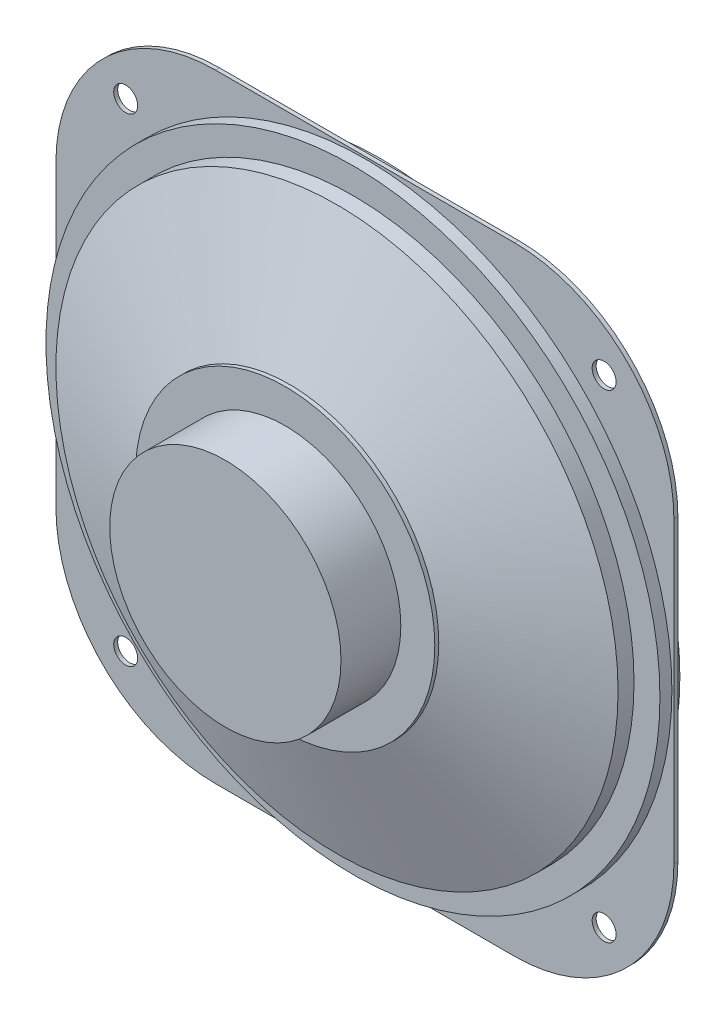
ISO-10303-21;
HEADER;
FILE_DESCRIPTION(('STEP AP214'),'2;1');
FILE_NAME('part.step','',(''),(''),'','','');
FILE_SCHEMA(('AUTOMOTIVE_DESIGN { 1 0 10303 214 1 1 1 1 }'));
ENDSEC;
DATA;
#1=APPLICATION_CONTEXT('core data for automotive mechanical design processes');
#2=APPLICATION_PROTOCOL_DEFINITION('international standard','automotive_design',2000,#1);
#3=PRODUCT_CONTEXT('',#1,'mechanical');
#4=PRODUCT('Part','Part','',(#3));
#5=PRODUCT_RELATED_PRODUCT_CATEGORY('part','',(#4));
#6=PRODUCT_DEFINITION_FORMATION('','',#4);
#7=PRODUCT_DEFINITION_CONTEXT('part definition',#1,'design');
#8=PRODUCT_DEFINITION('design','',#6,#7);
#9=PRODUCT_DEFINITION_SHAPE('','',#8);
#10=(LENGTH_UNIT() NAMED_UNIT(*) SI_UNIT(.MILLI.,.METRE.));
#11=(NAMED_UNIT(*) PLANE_ANGLE_UNIT() SI_UNIT($,.RADIAN.));
#12=(NAMED_UNIT(*) SI_UNIT($,.STERADIAN.) SOLID_ANGLE_UNIT());
#13=UNCERTAINTY_MEASURE_WITH_UNIT(LENGTH_MEASURE(1.E-05),#10,'distance_accuracy_value','');
#14=(GEOMETRIC_REPRESENTATION_CONTEXT(3) GLOBAL_UNCERTAINTY_ASSIGNED_CONTEXT((#13)) GLOBAL_UNIT_ASSIGNED_CONTEXT((#10,
#11,#12)) REPRESENTATION_CONTEXT('',''));
#15=CARTESIAN_POINT('',(0.,0.,0.));
#16=DIRECTION('',(0.,0.,1.));
#17=DIRECTION('',(1.,0.,0.));
#18=AXIS2_PLACEMENT_3D('',#15,#16,#17);
#19=CARTESIAN_POINT('',(0.,0.,18.));
#20=DIRECTION('',(0.,0.,-1.));
#21=DIRECTION('',(-1.,0.,0.));
#22=AXIS2_PLACEMENT_3D('',#19,#20,#21);
#23=CYLINDRICAL_SURFACE('',#22,14.5026515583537);
#24=CARTESIAN_POINT('',(0.,0.,18.));
#25=DIRECTION('',(0.,0.,1.));
#26=DIRECTION('',(1.,0.,0.));
#27=AXIS2_PLACEMENT_3D('',#24,#25,#26);
#28=CIRCLE('',#27,14.5026515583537);
#29=CARTESIAN_POINT('',(14.5026515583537,0.,18.));
#30=VERTEX_POINT('',#29);
#31=EDGE_CURVE('E11',#30,#30,#28,.T.);
#32=ORIENTED_EDGE('',*,*,#31,.F.);
#33=EDGE_LOOP('',(#32));
#34=FACE_BOUND('',#33,.T.);
#35=CARTESIAN_POINT('',(0.,0.,10.5));
#36=DIRECTION('',(0.,0.,1.));
#37=DIRECTION('',(1.,0.,0.));
#38=AXIS2_PLACEMENT_3D('',#35,#36,#37);
#39=CIRCLE('',#38,14.5026515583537);
#40=CARTESIAN_POINT('',(14.5026515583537,0.,10.5));
#41=VERTEX_POINT('',#40);
#42=EDGE_CURVE('E63',#41,#41,#39,.T.);
#43=ORIENTED_EDGE('',*,*,#42,.T.);
#44=EDGE_LOOP('',(#43));
#45=FACE_BOUND('',#44,.T.);
#46=ADVANCED_FACE('F60',(#34,#45),#23,.T.);
#47=CARTESIAN_POINT('',(0.,0.,18.));
#48=DIRECTION('',(0.,0.,1.));
#49=DIRECTION('',(1.,0.,0.));
#50=AXIS2_PLACEMENT_3D('',#47,#48,#49);
#51=PLANE('',#50);
#52=ORIENTED_EDGE('',*,*,#31,.T.);
#53=EDGE_LOOP('',(#52));
#54=FACE_BOUND('',#53,.T.);
#55=ADVANCED_FACE('F75',(#54),#51,.T.);
#56=CARTESIAN_POINT('',(0.,0.,10.5));
#57=DIRECTION('',(0.,0.,1.));
#58=DIRECTION('',(1.,0.,0.));
#59=AXIS2_PLACEMENT_3D('',#56,#57,#58);
#60=PLANE('',#59);
#61=ORIENTED_EDGE('',*,*,#42,.F.);
#62=EDGE_LOOP('',(#61));
#63=FACE_BOUND('',#62,.T.);
#64=ADVANCED_FACE('F73',(#63),#60,.F.);
#65=CLOSED_SHELL('',(#46,#55,#64));
#66=MANIFOLD_SOLID_BREP('B2',#65);
#67=CARTESIAN_POINT('',(0.,0.,2.));
#68=DIRECTION('',(0.,0.,1.));
#69=DIRECTION('',(1.,0.,0.));
#70=AXIS2_PLACEMENT_3D('',#67,#68,#69);
#71=PLANE('',#70);
#72=CARTESIAN_POINT('',(0.,0.,2.));
#73=DIRECTION('',(0.,0.,1.));
#74=DIRECTION('',(1.,0.,0.));
#75=AXIS2_PLACEMENT_3D('',#72,#73,#74);
#76=CIRCLE('',#75,34.4848645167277);
#77=CARTESIAN_POINT('',(-34.4848645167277,0.,2.));
#78=VERTEX_POINT('',#77);
#79=EDGE_CURVE('E136',#78,#78,#76,.T.);
#80=ORIENTED_EDGE('',*,*,#79,.T.);
#81=EDGE_LOOP('',(#80));
#82=FACE_BOUND('',#81,.T.);
#83=CARTESIAN_POINT('',(0.,0.,2.));
#84=DIRECTION('',(0.,0.,1.));
#85=DIRECTION('',(1.,0.,0.));
#86=AXIS2_PLACEMENT_3D('',#83,#84,#85);
#87=CIRCLE('',#86,35.25);
#88=CARTESIAN_POINT('',(35.25,0.,2.));
#89=VERTEX_POINT('',#88);
#90=EDGE_CURVE('E152',#89,#89,#87,.T.);
#91=ORIENTED_EDGE('',*,*,#90,.F.);
#92=EDGE_LOOP('',(#91));
#93=FACE_BOUND('',#92,.T.);
#94=ADVANCED_FACE('F127',(#82,#93),#71,.F.);
#95=CARTESIAN_POINT('',(0.,0.,10.));
#96=DIRECTION('',(0.,0.,-1.));
#97=DIRECTION('',(-1.,0.,0.));
#98=AXIS2_PLACEMENT_3D('',#95,#96,#97);
#99=CYLINDRICAL_SURFACE('',#98,35.25);
#100=CARTESIAN_POINT('',(0.,0.,3.99999999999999));
#101=DIRECTION('',(0.,0.,1.));
#102=DIRECTION('',(1.,0.,0.));
#103=AXIS2_PLACEMENT_3D('',#100,#101,#102);
#104=CIRCLE('',#103,35.25);
#105=CARTESIAN_POINT('',(35.25,0.,3.99999999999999));
#106=VERTEX_POINT('',#105);
#107=EDGE_CURVE('E141',#106,#106,#104,.F.);
#108=ORIENTED_EDGE('',*,*,#107,.T.);
#109=EDGE_LOOP('',(#108));
#110=FACE_BOUND('',#109,.T.);
#111=ORIENTED_EDGE('',*,*,#90,.T.);
#112=EDGE_LOOP('',(#111));
#113=FACE_BOUND('',#112,.T.);
#114=ADVANCED_FACE('F193',(#110,#113),#99,.T.);
#115=CARTESIAN_POINT('',(0.,0.,10.));
#116=DIRECTION('',(0.,0.,-1.));
#117=DIRECTION('',(-1.,0.,0.));
#118=AXIS2_PLACEMENT_3D('',#115,#116,#117);
#119=CYLINDRICAL_SURFACE('',#118,18.);
#120=CARTESIAN_POINT('',(0.,0.,8.00000000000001));
#121=DIRECTION('',(0.,0.,1.));
#122=DIRECTION('',(1.,0.,0.));
#123=AXIS2_PLACEMENT_3D('',#120,#121,#122);
#124=CIRCLE('',#123,18.);
#125=CARTESIAN_POINT('',(-18.,0.,8.00000000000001));
#126=VERTEX_POINT('',#125);
#127=EDGE_CURVE('E59',#126,#126,#124,.F.);
#128=ORIENTED_EDGE('',*,*,#127,.T.);
#129=EDGE_LOOP('',(#128));
#130=FACE_BOUND('',#129,.T.);
#131=CARTESIAN_POINT('',(0.,0.,10.));
#132=DIRECTION('',(0.,0.,1.));
#133=DIRECTION('',(1.,0.,0.));
#134=AXIS2_PLACEMENT_3D('',#131,#132,#133);
#135=CIRCLE('',#134,18.);
#136=CARTESIAN_POINT('',(18.,0.,10.));
#137=VERTEX_POINT('',#136);
#138=EDGE_CURVE('E156',#137,#137,#135,.T.);
#139=ORIENTED_EDGE('',*,*,#138,.T.);
#140=EDGE_LOOP('',(#139));
#141=FACE_BOUND('',#140,.T.);
#142=ADVANCED_FACE('F200',(#130,#141),#119,.F.);
#143=CARTESIAN_POINT('',(0.,0.,10.));
#144=DIRECTION('',(0.,0.,-1.));
#145=DIRECTION('',(-1.,0.,0.));
#146=AXIS2_PLACEMENT_3D('',#143,#144,#145);
#147=CONICAL_SURFACE('',#146,18.7651354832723,1.22173047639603);
#148=ORIENTED_EDGE('',*,*,#107,.F.);
#149=EDGE_LOOP('',(#148));
#150=FACE_BOUND('',#149,.T.);
#151=CARTESIAN_POINT('',(0.,0.,10.));
#152=DIRECTION('',(0.,0.,1.));
#153=DIRECTION('',(1.,0.,0.));
#154=AXIS2_PLACEMENT_3D('',#151,#152,#153);
#155=CIRCLE('',#154,18.7651354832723);
#156=CARTESIAN_POINT('',(18.7651354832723,0.,10.));
#157=VERTEX_POINT('',#156);
#158=EDGE_CURVE('E146',#157,#157,#155,.T.);
#159=ORIENTED_EDGE('',*,*,#158,.F.);
#160=EDGE_LOOP('',(#159));
#161=FACE_BOUND('',#160,.T.);
#162=ADVANCED_FACE('F188',(#150,#161),#147,.T.);
#163=CARTESIAN_POINT('',(0.,0.,10.));
#164=DIRECTION('',(0.,0.,1.));
#165=DIRECTION('',(1.,0.,0.));
#166=AXIS2_PLACEMENT_3D('',#163,#164,#165);
#167=PLANE('',#166);
#168=CARTESIAN_POINT('',(0.,0.,10.));
#169=DIRECTION('',(0.,0.,1.));
#170=DIRECTION('',(1.,0.,0.));
#171=AXIS2_PLACEMENT_3D('',#168,#169,#170);
#172=CIRCLE('',#171,14.5026515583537);
#173=CARTESIAN_POINT('',(14.5026515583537,0.,10.));
#174=VERTEX_POINT('',#173);
#175=EDGE_CURVE('E165',#174,#174,#172,.T.);
#176=ORIENTED_EDGE('',*,*,#175,.T.);
#177=EDGE_LOOP('',(#176));
#178=FACE_BOUND('',#177,.T.);
#179=ORIENTED_EDGE('',*,*,#138,.F.);
#180=EDGE_LOOP('',(#179));
#181=FACE_BOUND('',#180,.T.);
#182=ADVANCED_FACE('F179',(#178,#181),#167,.F.);
#183=CARTESIAN_POINT('',(0.,0.,10.5));
#184=DIRECTION('',(0.,0.,1.));
#185=DIRECTION('',(1.,0.,0.));
#186=AXIS2_PLACEMENT_3D('',#183,#184,#185);
#187=PLANE('',#186);
#188=CARTESIAN_POINT('',(0.,0.,10.5));
#189=DIRECTION('',(0.,0.,1.));
#190=DIRECTION('',(1.,0.,0.));
#191=AXIS2_PLACEMENT_3D('',#188,#189,#190);
#192=CIRCLE('',#191,18.7651354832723);
#193=CARTESIAN_POINT('',(18.7651354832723,0.,10.5));
#194=VERTEX_POINT('',#193);
#195=EDGE_CURVE('E160',#194,#194,#192,.T.);
#196=ORIENTED_EDGE('',*,*,#195,.T.);
#197=EDGE_LOOP('',(#196));
#198=FACE_BOUND('',#197,.T.);
#199=CARTESIAN_POINT('',(0.,0.,10.5));
#200=DIRECTION('',(0.,0.,1.));
#201=DIRECTION('',(1.,0.,0.));
#202=AXIS2_PLACEMENT_3D('',#199,#200,#201);
#203=CIRCLE('',#202,14.5026515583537);
#204=CARTESIAN_POINT('',(14.5026515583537,0.,10.5));
#205=VERTEX_POINT('',#204);
#206=EDGE_CURVE('E164',#205,#205,#203,.T.);
#207=ORIENTED_EDGE('',*,*,#206,.F.);
#208=EDGE_LOOP('',(#207));
#209=FACE_BOUND('',#208,.T.);
#210=ADVANCED_FACE('F176',(#198,#209),#187,.T.);
#211=CARTESIAN_POINT('',(0.,0.,10.5));
#212=DIRECTION('',(0.,0.,-1.));
#213=DIRECTION('',(-1.,0.,0.));
#214=AXIS2_PLACEMENT_3D('',#211,#212,#213);
#215=CYLINDRICAL_SURFACE('',#214,18.7651354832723);
#216=ORIENTED_EDGE('',*,*,#195,.F.);
#217=EDGE_LOOP('',(#216));
#218=FACE_BOUND('',#217,.T.);
#219=ORIENTED_EDGE('',*,*,#158,.T.);
#220=EDGE_LOOP('',(#219));
#221=FACE_BOUND('',#220,.T.);
#222=ADVANCED_FACE('F178',(#218,#221),#215,.T.);
#223=CARTESIAN_POINT('',(0.,0.,10.5));
#224=DIRECTION('',(0.,0.,-1.));
#225=DIRECTION('',(-1.,0.,0.));
#226=AXIS2_PLACEMENT_3D('',#223,#224,#225);
#227=CYLINDRICAL_SURFACE('',#226,14.5026515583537);
#228=ORIENTED_EDGE('',*,*,#206,.T.);
#229=EDGE_LOOP('',(#228));
#230=FACE_BOUND('',#229,.T.);
#231=ORIENTED_EDGE('',*,*,#175,.F.);
#232=EDGE_LOOP('',(#231));
#233=FACE_BOUND('',#232,.T.);
#234=ADVANCED_FACE('F173',(#230,#233),#227,.F.);
#235=CARTESIAN_POINT('',(0.,0.,2.));
#236=DIRECTION('',(0.,0.,-1.));
#237=DIRECTION('',(-1.,0.,0.));
#238=AXIS2_PLACEMENT_3D('',#235,#236,#237);
#239=CONICAL_SURFACE('',#238,34.4848645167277,1.22173047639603);
#240=CARTESIAN_POINT('',(-18.,0.,8.00000000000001));
#241=CARTESIAN_POINT('',(-18.1717173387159,0.,7.93750000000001));
#242=CARTESIAN_POINT('',(-18.3434346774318,0.,7.87500000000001));
#243=CARTESIAN_POINT('',(-18.6868693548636,0.,7.75000000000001));
#244=CARTESIAN_POINT('',(-18.8585866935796,0.,7.68750000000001));
#245=CARTESIAN_POINT('',(-19.2020213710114,0.,7.56250000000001));
#246=CARTESIAN_POINT('',(-19.3737387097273,0.,7.50000000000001));
#247=CARTESIAN_POINT('',(-19.7171733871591,0.,7.37500000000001));
#248=CARTESIAN_POINT('',(-19.888890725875,0.,7.31250000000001));
#249=CARTESIAN_POINT('',(-20.2323254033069,0.,7.18750000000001));
#250=CARTESIAN_POINT('',(-20.4040427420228,0.,7.12500000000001));
#251=CARTESIAN_POINT('',(-20.7474774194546,0.,7.00000000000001));
#252=CARTESIAN_POINT('',(-20.9191947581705,0.,6.93750000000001));
#253=CARTESIAN_POINT('',(-21.2626294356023,0.,6.81250000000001));
#254=CARTESIAN_POINT('',(-21.4343467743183,0.,6.75000000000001));
#255=CARTESIAN_POINT('',(-21.7777814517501,0.,6.62500000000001));
#256=CARTESIAN_POINT('',(-21.949498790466,0.,6.56250000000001));
#257=CARTESIAN_POINT('',(-22.2929334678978,0.,6.4375));
#258=CARTESIAN_POINT('',(-22.4646508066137,0.,6.375));
#259=CARTESIAN_POINT('',(-22.8080854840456,0.,6.25));
#260=CARTESIAN_POINT('',(-22.9798028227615,0.,6.1875));
#261=CARTESIAN_POINT('',(-23.3232375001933,0.,6.0625));
#262=CARTESIAN_POINT('',(-23.4949548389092,0.,6.));
#263=CARTESIAN_POINT('',(-23.8383895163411,0.,5.875));
#264=CARTESIAN_POINT('',(-24.010106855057,0.,5.8125));
#265=CARTESIAN_POINT('',(-24.3535415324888,0.,5.6875));
#266=CARTESIAN_POINT('',(-24.5252588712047,0.,5.625));
#267=CARTESIAN_POINT('',(-24.8686935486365,0.,5.5));
#268=CARTESIAN_POINT('',(-25.0404108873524,0.,5.4375));
#269=CARTESIAN_POINT('',(-25.3838455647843,0.,5.3125));
#270=CARTESIAN_POINT('',(-25.5555629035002,0.,5.25));
#271=CARTESIAN_POINT('',(-25.898997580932,0.,5.125));
#272=CARTESIAN_POINT('',(-26.0707149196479,0.,5.0625));
#273=CARTESIAN_POINT('',(-26.4141495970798,0.,4.9375));
#274=CARTESIAN_POINT('',(-26.5858669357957,0.,4.875));
#275=CARTESIAN_POINT('',(-26.9293016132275,0.,4.75));
#276=CARTESIAN_POINT('',(-27.1010189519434,0.,4.6875));
#277=CARTESIAN_POINT('',(-27.4444536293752,0.,4.5625));
#278=CARTESIAN_POINT('',(-27.6161709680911,0.,4.5));
#279=CARTESIAN_POINT('',(-27.959605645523,0.,4.375));
#280=CARTESIAN_POINT('',(-28.1313229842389,0.,4.3125));
#281=CARTESIAN_POINT('',(-28.4747576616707,0.,4.1875));
#282=CARTESIAN_POINT('',(-28.6464750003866,0.,4.125));
#283=CARTESIAN_POINT('',(-28.9899096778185,0.,4.));
#284=CARTESIAN_POINT('',(-29.1616270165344,0.,3.9375));
#285=CARTESIAN_POINT('',(-29.5050616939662,0.,3.8125));
#286=CARTESIAN_POINT('',(-29.6767790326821,0.,3.75));
#287=CARTESIAN_POINT('',(-30.0202137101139,0.,3.625));
#288=CARTESIAN_POINT('',(-30.1919310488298,0.,3.5625));
#289=CARTESIAN_POINT('',(-30.5353657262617,0.,3.4375));
#290=CARTESIAN_POINT('',(-30.7070830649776,0.,3.375));
#291=CARTESIAN_POINT('',(-31.0505177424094,0.,3.25));
#292=CARTESIAN_POINT('',(-31.2222350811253,0.,3.1875));
#293=CARTESIAN_POINT('',(-31.5656697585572,0.,3.0625));
#294=CARTESIAN_POINT('',(-31.7373870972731,0.,3.));
#295=CARTESIAN_POINT('',(-32.0808217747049,0.,2.875));
#296=CARTESIAN_POINT('',(-32.2525391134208,0.,2.8125));
#297=CARTESIAN_POINT('',(-32.5959737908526,0.,2.6875));
#298=CARTESIAN_POINT('',(-32.7676911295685,0.,2.625));
#299=CARTESIAN_POINT('',(-33.1111258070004,0.,2.5));
#300=CARTESIAN_POINT('',(-33.2828431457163,0.,2.4375));
#301=CARTESIAN_POINT('',(-33.6262778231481,0.,2.3125));
#302=CARTESIAN_POINT('',(-33.797995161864,0.,2.25));
#303=CARTESIAN_POINT('',(-34.1414298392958,0.,2.125));
#304=CARTESIAN_POINT('',(-34.3131471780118,0.,2.0625));
#305=CARTESIAN_POINT('',(-34.4848645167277,0.,2.));
#306=B_SPLINE_CURVE_WITH_KNOTS('',3,(#240,#241,#242,#243,#244,#245,#246,#247,#248,#249,#250,
#251,#252,#253,#254,#255,#256,#257,#258,#259,#260,#261,#262,#263,#264,#265,#266,#267,#268,#269,
#270,#271,#272,#273,#274,#275,#276,#277,#278,#279,#280,#281,#282,#283,#284,#285,#286,#287,#288,
#289,#290,#291,#292,#293,#294,#295,#296,#297,#298,#299,#300,#301,#302,#303,#304,#305),
.UNSPECIFIED.,.F.,.F.,(4,2,2,2,2,2,2,2,2,2,2,2,2,2,2,2,2,2,2,2,2,2,2,2,2,2,2,2,2,2,2,2,4),(0.,
0.548213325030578,1.09642665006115,1.64463997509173,2.19285330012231,2.74106662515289,
3.28927995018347,3.83749327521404,4.38570660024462,4.93391992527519,5.48213325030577,
6.03034657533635,6.57855990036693,7.12677322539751,7.67498655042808,8.22319987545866,
8.77141320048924,9.31962652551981,9.86783985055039,10.416053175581,10.9642665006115,
11.5124798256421,12.0606931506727,12.6089064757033,13.1571198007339,13.7053331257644,
14.253546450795,14.8017597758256,15.3499731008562,15.8981864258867,16.4463997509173,
16.9946130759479,17.5428264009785),.UNSPECIFIED.);
#307=EDGE_CURVE('BSEAM130',#126,#78,#306,.T.);
#308=ORIENTED_EDGE('',*,*,#127,.F.);
#309=ORIENTED_EDGE('',*,*,#79,.F.);
#310=ORIENTED_EDGE('',*,*,#307,.T.);
#311=ORIENTED_EDGE('',*,*,#307,.F.);
#312=EDGE_LOOP('',(#308,#310,#309,#311));
#313=FACE_BOUND('',#312,.T.);
#314=ADVANCED_FACE('F130',(#313),#239,.F.);
#315=CLOSED_SHELL('',(#94,#114,#142,#162,#182,#210,#222,#234,#314));
#316=MANIFOLD_SOLID_BREP('B6',#315);
#317=CARTESIAN_POINT('',(0.,0.,0.5));
#318=DIRECTION('',(0.,0.,1.));
#319=DIRECTION('',(1.,0.,0.));
#320=AXIS2_PLACEMENT_3D('',#317,#318,#319);
#321=PLANE('',#320);
#322=CARTESIAN_POINT('',(0.,0.,0.5));
#323=DIRECTION('',(0.,0.,1.));
#324=DIRECTION('',(1.,0.,0.));
#325=AXIS2_PLACEMENT_3D('',#322,#323,#324);
#326=CIRCLE('',#325,35.25);
#327=CARTESIAN_POINT('',(35.25,0.,0.5));
#328=VERTEX_POINT('',#327);
#329=EDGE_CURVE('E304',#328,#328,#326,.T.);
#330=ORIENTED_EDGE('',*,*,#329,.T.);
#331=EDGE_LOOP('',(#330));
#332=FACE_BOUND('',#331,.T.);
#333=CARTESIAN_POINT('',(0.,0.,0.5));
#334=DIRECTION('',(0.,0.,1.));
#335=DIRECTION('',(1.,0.,0.));
#336=AXIS2_PLACEMENT_3D('',#333,#334,#335);
#337=CIRCLE('',#336,35.5);
#338=CARTESIAN_POINT('',(-35.5,0.,0.5));
#339=VERTEX_POINT('',#338);
#340=EDGE_CURVE('E126',#339,#339,#337,.T.);
#341=ORIENTED_EDGE('',*,*,#340,.F.);
#342=EDGE_LOOP('',(#341));
#343=FACE_BOUND('',#342,.T.);
#344=ADVANCED_FACE('F286',(#332,#343),#321,.F.);
#345=CARTESIAN_POINT('',(0.,0.,2.));
#346=DIRECTION('',(0.,0.,1.));
#347=DIRECTION('',(1.,0.,0.));
#348=AXIS2_PLACEMENT_3D('',#345,#346,#347);
#349=PLANE('',#348);
#350=CARTESIAN_POINT('',(0.,0.,2.));
#351=DIRECTION('',(0.,0.,1.));
#352=DIRECTION('',(1.,0.,0.));
#353=AXIS2_PLACEMENT_3D('',#350,#351,#352);
#354=CIRCLE('',#353,38.5);
#355=CARTESIAN_POINT('',(38.5,0.,2.));
#356=VERTEX_POINT('',#355);
#357=EDGE_CURVE('E294',#356,#356,#354,.T.);
#358=ORIENTED_EDGE('',*,*,#357,.T.);
#359=EDGE_LOOP('',(#358));
#360=FACE_BOUND('',#359,.T.);
#361=CARTESIAN_POINT('',(0.,0.,2.));
#362=DIRECTION('',(0.,0.,1.));
#363=DIRECTION('',(1.,0.,0.));
#364=AXIS2_PLACEMENT_3D('',#361,#362,#363);
#365=CIRCLE('',#364,35.25);
#366=CARTESIAN_POINT('',(35.25,0.,2.));
#367=VERTEX_POINT('',#366);
#368=EDGE_CURVE('E302',#367,#367,#365,.T.);
#369=ORIENTED_EDGE('',*,*,#368,.F.);
#370=EDGE_LOOP('',(#369));
#371=FACE_BOUND('',#370,.T.);
#372=ADVANCED_FACE('F328',(#360,#371),#349,.T.);
#373=CARTESIAN_POINT('',(0.,0.,0.5));
#374=DIRECTION('',(0.,0.,1.));
#375=DIRECTION('',(1.,0.,0.));
#376=AXIS2_PLACEMENT_3D('',#373,#374,#375);
#377=CIRCLE('',#376,37.5);
#378=CARTESIAN_POINT('',(-37.5,0.,0.5));
#379=VERTEX_POINT('',#378);
#380=EDGE_CURVE('E290',#379,#379,#377,.T.);
#381=ORIENTED_EDGE('',*,*,#380,.T.);
#382=EDGE_LOOP('',(#381));
#383=FACE_BOUND('',#382,.T.);
#384=CARTESIAN_POINT('',(0.,0.,0.5));
#385=DIRECTION('',(0.,0.,1.));
#386=DIRECTION('',(1.,0.,0.));
#387=AXIS2_PLACEMENT_3D('',#384,#385,#386);
#388=CIRCLE('',#387,38.5);
#389=CARTESIAN_POINT('',(38.5,0.,0.5));
#390=VERTEX_POINT('',#389);
#391=EDGE_CURVE('E298',#390,#390,#388,.T.);
#392=ORIENTED_EDGE('',*,*,#391,.F.);
#393=EDGE_LOOP('',(#392));
#394=FACE_BOUND('',#393,.T.);
#395=ADVANCED_FACE('F330',(#383,#394),#321,.F.);
#396=CARTESIAN_POINT('',(0.,0.,2.));
#397=DIRECTION('',(0.,0.,-1.));
#398=DIRECTION('',(-1.,0.,0.));
#399=AXIS2_PLACEMENT_3D('',#396,#397,#398);
#400=CYLINDRICAL_SURFACE('',#399,38.5);
#401=ORIENTED_EDGE('',*,*,#357,.F.);
#402=EDGE_LOOP('',(#401));
#403=FACE_BOUND('',#402,.T.);
#404=ORIENTED_EDGE('',*,*,#391,.T.);
#405=EDGE_LOOP('',(#404));
#406=FACE_BOUND('',#405,.T.);
#407=ADVANCED_FACE('F288',(#403,#406),#400,.T.);
#408=CARTESIAN_POINT('',(0.,0.,2.));
#409=DIRECTION('',(0.,0.,-1.));
#410=DIRECTION('',(-1.,0.,0.));
#411=AXIS2_PLACEMENT_3D('',#408,#409,#410);
#412=CYLINDRICAL_SURFACE('',#411,35.25);
#413=ORIENTED_EDGE('',*,*,#368,.T.);
#414=EDGE_LOOP('',(#413));
#415=FACE_BOUND('',#414,.T.);
#416=ORIENTED_EDGE('',*,*,#329,.F.);
#417=EDGE_LOOP('',(#416));
#418=FACE_BOUND('',#417,.T.);
#419=ADVANCED_FACE('F344',(#415,#418),#412,.F.);
#420=CARTESIAN_POINT('',(0.,0.,1.9));
#421=DIRECTION('',(0.,0.,-1.));
#422=DIRECTION('',(-1.,0.,0.));
#423=AXIS2_PLACEMENT_3D('',#420,#421,#422);
#424=CYLINDRICAL_SURFACE('',#423,37.5);
#425=CARTESIAN_POINT('',(0.,0.,-1.5));
#426=DIRECTION('',(0.,0.,-1.));
#427=DIRECTION('',(-1.,0.,0.));
#428=AXIS2_PLACEMENT_3D('',#425,#426,#427);
#429=CIRCLE('',#428,37.5);
#430=CARTESIAN_POINT('',(-37.5,0.,-1.5));
#431=VERTEX_POINT('',#430);
#432=EDGE_CURVE('E309',#431,#431,#429,.T.);
#433=CARTESIAN_POINT('',(-37.5,0.,-1.5));
#434=CARTESIAN_POINT('',(-37.5,0.,-1.47916666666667));
#435=CARTESIAN_POINT('',(-37.5,0.,-1.45833333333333));
#436=CARTESIAN_POINT('',(-37.5,0.,-1.41666666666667));
#437=CARTESIAN_POINT('',(-37.5,0.,-1.39583333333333));
#438=CARTESIAN_POINT('',(-37.5,0.,-1.35416666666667));
#439=CARTESIAN_POINT('',(-37.5,0.,-1.33333333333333));
#440=CARTESIAN_POINT('',(-37.5,0.,-1.29166666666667));
#441=CARTESIAN_POINT('',(-37.5,0.,-1.27083333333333));
#442=CARTESIAN_POINT('',(-37.5,0.,-1.22916666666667));
#443=CARTESIAN_POINT('',(-37.5,0.,-1.20833333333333));
#444=CARTESIAN_POINT('',(-37.5,0.,-1.16666666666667));
#445=CARTESIAN_POINT('',(-37.5,0.,-1.14583333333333));
#446=CARTESIAN_POINT('',(-37.5,0.,-1.10416666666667));
#447=CARTESIAN_POINT('',(-37.5,0.,-1.08333333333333));
#448=CARTESIAN_POINT('',(-37.5,0.,-1.04166666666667));
#449=CARTESIAN_POINT('',(-37.5,0.,-1.02083333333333));
#450=CARTESIAN_POINT('',(-37.5,0.,-0.979166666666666));
#451=CARTESIAN_POINT('',(-37.5,0.,-0.958333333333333));
#452=CARTESIAN_POINT('',(-37.5,0.,-0.916666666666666));
#453=CARTESIAN_POINT('',(-37.5,0.,-0.895833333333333));
#454=CARTESIAN_POINT('',(-37.5,0.,-0.854166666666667));
#455=CARTESIAN_POINT('',(-37.5,0.,-0.833333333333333));
#456=CARTESIAN_POINT('',(-37.5,0.,-0.791666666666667));
#457=CARTESIAN_POINT('',(-37.5,0.,-0.770833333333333));
#458=CARTESIAN_POINT('',(-37.5,0.,-0.729166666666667));
#459=CARTESIAN_POINT('',(-37.5,0.,-0.708333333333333));
#460=CARTESIAN_POINT('',(-37.5,0.,-0.666666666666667));
#461=CARTESIAN_POINT('',(-37.5,0.,-0.645833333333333));
#462=CARTESIAN_POINT('',(-37.5,0.,-0.604166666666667));
#463=CARTESIAN_POINT('',(-37.5,0.,-0.583333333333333));
#464=CARTESIAN_POINT('',(-37.5,0.,-0.541666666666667));
#465=CARTESIAN_POINT('',(-37.5,0.,-0.520833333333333));
#466=CARTESIAN_POINT('',(-37.5,0.,-0.479166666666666));
#467=CARTESIAN_POINT('',(-37.5,0.,-0.458333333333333));
#468=CARTESIAN_POINT('',(-37.5,0.,-0.416666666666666));
#469=CARTESIAN_POINT('',(-37.5,0.,-0.395833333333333));
#470=CARTESIAN_POINT('',(-37.5,0.,-0.354166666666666));
#471=CARTESIAN_POINT('',(-37.5,0.,-0.333333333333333));
#472=CARTESIAN_POINT('',(-37.5,0.,-0.291666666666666));
#473=CARTESIAN_POINT('',(-37.5,0.,-0.270833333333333));
#474=CARTESIAN_POINT('',(-37.5,0.,-0.229166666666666));
#475=CARTESIAN_POINT('',(-37.5,0.,-0.208333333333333));
#476=CARTESIAN_POINT('',(-37.5,0.,-0.166666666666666));
#477=CARTESIAN_POINT('',(-37.5,0.,-0.145833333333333));
#478=CARTESIAN_POINT('',(-37.5,0.,-0.104166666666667));
#479=CARTESIAN_POINT('',(-37.5,0.,-0.0833333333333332));
#480=CARTESIAN_POINT('',(-37.5,0.,-0.0416666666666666));
#481=CARTESIAN_POINT('',(-37.5,0.,-0.0208333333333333));
#482=CARTESIAN_POINT('',(-37.5,0.,0.0208333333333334));
#483=CARTESIAN_POINT('',(-37.5,0.,0.0416666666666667));
#484=CARTESIAN_POINT('',(-37.5,0.,0.0833333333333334));
#485=CARTESIAN_POINT('',(-37.5,0.,0.104166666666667));
#486=CARTESIAN_POINT('',(-37.5,0.,0.145833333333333));
#487=CARTESIAN_POINT('',(-37.5,0.,0.166666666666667));
#488=CARTESIAN_POINT('',(-37.5,0.,0.208333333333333));
#489=CARTESIAN_POINT('',(-37.5,0.,0.229166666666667));
#490=CARTESIAN_POINT('',(-37.5,0.,0.270833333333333));
#491=CARTESIAN_POINT('',(-37.5,0.,0.291666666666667));
#492=CARTESIAN_POINT('',(-37.5,0.,0.333333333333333));
#493=CARTESIAN_POINT('',(-37.5,0.,0.354166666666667));
#494=CARTESIAN_POINT('',(-37.5,0.,0.395833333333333));
#495=CARTESIAN_POINT('',(-37.5,0.,0.416666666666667));
#496=CARTESIAN_POINT('',(-37.5,0.,0.458333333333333));
#497=CARTESIAN_POINT('',(-37.5,0.,0.479166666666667));
#498=CARTESIAN_POINT('',(-37.5,0.,0.5));
#499=B_SPLINE_CURVE_WITH_KNOTS('',3,(#433,#434,#435,#436,#437,#438,#439,#440,#441,#442,#443,
#444,#445,#446,#447,#448,#449,#450,#451,#452,#453,#454,#455,#456,#457,#458,#459,#460,#461,#462,
#463,#464,#465,#466,#467,#468,#469,#470,#471,#472,#473,#474,#475,#476,#477,#478,#479,#480,#481,
#482,#483,#484,#485,#486,#487,#488,#489,#490,#491,#492,#493,#494,#495,#496,#497,#498),
.UNSPECIFIED.,.F.,.F.,(4,2,2,2,2,2,2,2,2,2,2,2,2,2,2,2,2,2,2,2,2,2,2,2,2,2,2,2,2,2,2,2,4),(0.,
0.0625000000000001,0.125,0.1875,0.25,0.3125,0.375,0.4375,0.5,0.5625,0.625,0.6875,0.75,0.8125,
0.875,0.9375,1.,1.0625,1.125,1.1875,1.25,1.3125,1.375,1.4375,1.5,1.5625,1.625,1.6875,1.75,
1.8125,1.875,1.9375,2.),.UNSPECIFIED.);
#500=EDGE_CURVE('BSEAM325',#431,#379,#499,.T.);
#501=ORIENTED_EDGE('',*,*,#432,.F.);
#502=ORIENTED_EDGE('',*,*,#380,.F.);
#503=ORIENTED_EDGE('',*,*,#500,.T.);
#504=ORIENTED_EDGE('',*,*,#500,.F.);
#505=EDGE_LOOP('',(#501,#503,#502,#504));
#506=FACE_BOUND('',#505,.T.);
#507=ADVANCED_FACE('F325',(#506),#424,.T.);
#508=CARTESIAN_POINT('',(0.,0.,1.9));
#509=DIRECTION('',(0.,0.,-1.));
#510=DIRECTION('',(-1.,0.,0.));
#511=AXIS2_PLACEMENT_3D('',#508,#509,#510);
#512=CYLINDRICAL_SURFACE('',#511,35.5);
#513=CARTESIAN_POINT('',(0.,0.,-1.5));
#514=DIRECTION('',(0.,0.,-1.));
#515=DIRECTION('',(-1.,0.,0.));
#516=AXIS2_PLACEMENT_3D('',#513,#514,#515);
#517=CIRCLE('',#516,35.5);
#518=CARTESIAN_POINT('',(-35.5,0.,-1.5));
#519=VERTEX_POINT('',#518);
#520=EDGE_CURVE('E312',#519,#519,#517,.T.);
#521=CARTESIAN_POINT('',(-35.5,0.,-1.5));
#522=CARTESIAN_POINT('',(-35.5,0.,-1.47916666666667));
#523=CARTESIAN_POINT('',(-35.5,0.,-1.45833333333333));
#524=CARTESIAN_POINT('',(-35.5,0.,-1.41666666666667));
#525=CARTESIAN_POINT('',(-35.5,0.,-1.39583333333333));
#526=CARTESIAN_POINT('',(-35.5,0.,-1.35416666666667));
#527=CARTESIAN_POINT('',(-35.5,0.,-1.33333333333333));
#528=CARTESIAN_POINT('',(-35.5,0.,-1.29166666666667));
#529=CARTESIAN_POINT('',(-35.5,0.,-1.27083333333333));
#530=CARTESIAN_POINT('',(-35.5,0.,-1.22916666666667));
#531=CARTESIAN_POINT('',(-35.5,0.,-1.20833333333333));
#532=CARTESIAN_POINT('',(-35.5,0.,-1.16666666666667));
#533=CARTESIAN_POINT('',(-35.5,0.,-1.14583333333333));
#534=CARTESIAN_POINT('',(-35.5,0.,-1.10416666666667));
#535=CARTESIAN_POINT('',(-35.5,0.,-1.08333333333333));
#536=CARTESIAN_POINT('',(-35.5,0.,-1.04166666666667));
#537=CARTESIAN_POINT('',(-35.5,0.,-1.02083333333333));
#538=CARTESIAN_POINT('',(-35.5,0.,-0.979166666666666));
#539=CARTESIAN_POINT('',(-35.5,0.,-0.958333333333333));
#540=CARTESIAN_POINT('',(-35.5,0.,-0.916666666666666));
#541=CARTESIAN_POINT('',(-35.5,0.,-0.895833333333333));
#542=CARTESIAN_POINT('',(-35.5,0.,-0.854166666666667));
#543=CARTESIAN_POINT('',(-35.5,0.,-0.833333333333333));
#544=CARTESIAN_POINT('',(-35.5,0.,-0.791666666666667));
#545=CARTESIAN_POINT('',(-35.5,0.,-0.770833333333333));
#546=CARTESIAN_POINT('',(-35.5,0.,-0.729166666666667));
#547=CARTESIAN_POINT('',(-35.5,0.,-0.708333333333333));
#548=CARTESIAN_POINT('',(-35.5,0.,-0.666666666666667));
#549=CARTESIAN_POINT('',(-35.5,0.,-0.645833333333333));
#550=CARTESIAN_POINT('',(-35.5,0.,-0.604166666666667));
#551=CARTESIAN_POINT('',(-35.5,0.,-0.583333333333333));
#552=CARTESIAN_POINT('',(-35.5,0.,-0.541666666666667));
#553=CARTESIAN_POINT('',(-35.5,0.,-0.520833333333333));
#554=CARTESIAN_POINT('',(-35.5,0.,-0.479166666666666));
#555=CARTESIAN_POINT('',(-35.5,0.,-0.458333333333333));
#556=CARTESIAN_POINT('',(-35.5,0.,-0.416666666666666));
#557=CARTESIAN_POINT('',(-35.5,0.,-0.395833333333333));
#558=CARTESIAN_POINT('',(-35.5,0.,-0.354166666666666));
#559=CARTESIAN_POINT('',(-35.5,0.,-0.333333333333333));
#560=CARTESIAN_POINT('',(-35.5,0.,-0.291666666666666));
#561=CARTESIAN_POINT('',(-35.5,0.,-0.270833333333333));
#562=CARTESIAN_POINT('',(-35.5,0.,-0.229166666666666));
#563=CARTESIAN_POINT('',(-35.5,0.,-0.208333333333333));
#564=CARTESIAN_POINT('',(-35.5,0.,-0.166666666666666));
#565=CARTESIAN_POINT('',(-35.5,0.,-0.145833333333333));
#566=CARTESIAN_POINT('',(-35.5,0.,-0.104166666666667));
#567=CARTESIAN_POINT('',(-35.5,0.,-0.0833333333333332));
#568=CARTESIAN_POINT('',(-35.5,0.,-0.0416666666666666));
#569=CARTESIAN_POINT('',(-35.5,0.,-0.0208333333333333));
#570=CARTESIAN_POINT('',(-35.5,0.,0.0208333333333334));
#571=CARTESIAN_POINT('',(-35.5,0.,0.0416666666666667));
#572=CARTESIAN_POINT('',(-35.5,0.,0.0833333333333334));
#573=CARTESIAN_POINT('',(-35.5,0.,0.104166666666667));
#574=CARTESIAN_POINT('',(-35.5,0.,0.145833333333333));
#575=CARTESIAN_POINT('',(-35.5,0.,0.166666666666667));
#576=CARTESIAN_POINT('',(-35.5,0.,0.208333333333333));
#577=CARTESIAN_POINT('',(-35.5,0.,0.229166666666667));
#578=CARTESIAN_POINT('',(-35.5,0.,0.270833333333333));
#579=CARTESIAN_POINT('',(-35.5,0.,0.291666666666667));
#580=CARTESIAN_POINT('',(-35.5,0.,0.333333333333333));
#581=CARTESIAN_POINT('',(-35.5,0.,0.354166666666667));
#582=CARTESIAN_POINT('',(-35.5,0.,0.395833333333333));
#583=CARTESIAN_POINT('',(-35.5,0.,0.416666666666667));
#584=CARTESIAN_POINT('',(-35.5,0.,0.458333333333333));
#585=CARTESIAN_POINT('',(-35.5,0.,0.479166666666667));
#586=CARTESIAN_POINT('',(-35.5,0.,0.5));
#587=B_SPLINE_CURVE_WITH_KNOTS('',3,(#521,#522,#523,#524,#525,#526,#527,#528,#529,#530,#531,
#532,#533,#534,#535,#536,#537,#538,#539,#540,#541,#542,#543,#544,#545,#546,#547,#548,#549,#550,
#551,#552,#553,#554,#555,#556,#557,#558,#559,#560,#561,#562,#563,#564,#565,#566,#567,#568,#569,
#570,#571,#572,#573,#574,#575,#576,#577,#578,#579,#580,#581,#582,#583,#584,#585,#586),
.UNSPECIFIED.,.F.,.F.,(4,2,2,2,2,2,2,2,2,2,2,2,2,2,2,2,2,2,2,2,2,2,2,2,2,2,2,2,2,2,2,2,4),(0.,
0.0625000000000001,0.125,0.1875,0.25,0.3125,0.375,0.4375,0.5,0.5625,0.625,0.6875,0.75,0.8125,
0.875,0.9375,1.,1.0625,1.125,1.1875,1.25,1.3125,1.375,1.4375,1.5,1.5625,1.625,1.6875,1.75,
1.8125,1.875,1.9375,2.),.UNSPECIFIED.);
#588=EDGE_CURVE('BSEAM316',#519,#339,#587,.T.);
#589=ORIENTED_EDGE('',*,*,#520,.T.);
#590=ORIENTED_EDGE('',*,*,#340,.T.);
#591=ORIENTED_EDGE('',*,*,#588,.T.);
#592=ORIENTED_EDGE('',*,*,#588,.F.);
#593=EDGE_LOOP('',(#589,#591,#590,#592));
#594=FACE_BOUND('',#593,.T.);
#595=ADVANCED_FACE('F316',(#594),#512,.F.);
#596=CARTESIAN_POINT('',(0.,0.,-1.5));
#597=DIRECTION('',(0.,0.,-1.));
#598=DIRECTION('',(-1.,0.,0.));
#599=AXIS2_PLACEMENT_3D('',#596,#597,#598);
#600=PLANE('',#599);
#601=ORIENTED_EDGE('',*,*,#432,.T.);
#602=EDGE_LOOP('',(#601));
#603=FACE_BOUND('',#602,.T.);
#604=ORIENTED_EDGE('',*,*,#520,.F.);
#605=EDGE_LOOP('',(#604));
#606=FACE_BOUND('',#605,.T.);
#607=ADVANCED_FACE('F318',(#603,#606),#600,.T.);
#608=CLOSED_SHELL('',(#344,#372,#395,#407,#419,#507,#595,#607));
#609=MANIFOLD_SOLID_BREP('B54',#608);
#610=CARTESIAN_POINT('',(18.75,-18.75,0.5));
#611=DIRECTION('',(0.,0.,1.));
#612=DIRECTION('',(1.,0.,0.));
#613=AXIS2_PLACEMENT_3D('',#610,#611,#612);
#614=PLANE('',#613);
#615=CARTESIAN_POINT('',(-30.,-30.,0.5));
#616=DIRECTION('',(0.,0.,1.));
#617=DIRECTION('',(1.,0.,0.));
#618=AXIS2_PLACEMENT_3D('',#615,#616,#617);
#619=CIRCLE('',#618,1.50000000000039);
#620=CARTESIAN_POINT('',(-28.4999999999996,-30.,0.5));
#621=VERTEX_POINT('',#620);
#622=EDGE_CURVE('E558',#621,#621,#619,.T.);
#623=ORIENTED_EDGE('',*,*,#622,.F.);
#624=EDGE_LOOP('',(#623));
#625=FACE_BOUND('',#624,.T.);
#626=CARTESIAN_POINT('',(30.,30.,0.5));
#627=DIRECTION('',(0.,0.,1.));
#628=DIRECTION('',(1.,0.,0.));
#629=AXIS2_PLACEMENT_3D('',#626,#627,#628);
#630=CIRCLE('',#629,1.50000000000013);
#631=CARTESIAN_POINT('',(31.5000000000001,30.,0.5));
#632=VERTEX_POINT('',#631);
#633=EDGE_CURVE('E546',#632,#632,#630,.T.);
#634=ORIENTED_EDGE('',*,*,#633,.F.);
#635=EDGE_LOOP('',(#634));
#636=FACE_BOUND('',#635,.T.);
#637=CARTESIAN_POINT('',(18.75,-18.75,0.5));
#638=DIRECTION('',(0.,0.,1.));
#639=DIRECTION('',(1.,0.,0.));
#640=AXIS2_PLACEMENT_3D('',#637,#638,#639);
#641=CIRCLE('',#640,20.);
#642=CARTESIAN_POINT('',(18.7499999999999,-38.75,0.5));
#643=VERTEX_POINT('',#642);
#644=CARTESIAN_POINT('',(38.75,-18.7499999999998,0.5));
#645=VERTEX_POINT('',#644);
#646=EDGE_CURVE('E509',#643,#645,#641,.T.);
#647=ORIENTED_EDGE('',*,*,#646,.T.);
#648=DIRECTION('',(0.,1.,0.));
#649=VECTOR('',#648,1.);
#650=CARTESIAN_POINT('',(38.75,18.7499999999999,0.5));
#651=LINE('',#650,#649);
#652=CARTESIAN_POINT('',(38.75,18.7499999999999,0.5));
#653=VERTEX_POINT('',#652);
#654=EDGE_CURVE('E457',#645,#653,#651,.T.);
#655=ORIENTED_EDGE('',*,*,#654,.T.);
#656=CARTESIAN_POINT('',(18.75,18.75,0.5));
#657=DIRECTION('',(0.,0.,1.));
#658=DIRECTION('',(1.,0.,0.));
#659=AXIS2_PLACEMENT_3D('',#656,#657,#658);
#660=CIRCLE('',#659,20.);
#661=CARTESIAN_POINT('',(18.7499999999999,38.75,0.5));
#662=VERTEX_POINT('',#661);
#663=EDGE_CURVE('E524',#653,#662,#660,.T.);
#664=ORIENTED_EDGE('',*,*,#663,.T.);
#665=DIRECTION('',(-1.,0.,0.));
#666=VECTOR('',#665,1.);
#667=CARTESIAN_POINT('',(18.7499999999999,38.75,0.5));
#668=LINE('',#667,#666);
#669=CARTESIAN_POINT('',(-18.7499999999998,38.75,0.5));
#670=VERTEX_POINT('',#669);
#671=EDGE_CURVE('E537',#662,#670,#668,.T.);
#672=ORIENTED_EDGE('',*,*,#671,.T.);
#673=CARTESIAN_POINT('',(-18.75,18.75,0.5));
#674=DIRECTION('',(0.,0.,1.));
#675=DIRECTION('',(1.,0.,0.));
#676=AXIS2_PLACEMENT_3D('',#673,#674,#675);
#677=CIRCLE('',#676,20.);
#678=CARTESIAN_POINT('',(-38.75,18.7499999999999,0.5));
#679=VERTEX_POINT('',#678);
#680=EDGE_CURVE('E476',#670,#679,#677,.T.);
#681=ORIENTED_EDGE('',*,*,#680,.T.);
#682=DIRECTION('',(0.,-1.,0.));
#683=VECTOR('',#682,1.);
#684=CARTESIAN_POINT('',(-38.75,18.7499999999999,0.5));
#685=LINE('',#684,#683);
#686=CARTESIAN_POINT('',(-38.75,-18.75,0.5));
#687=VERTEX_POINT('',#686);
#688=EDGE_CURVE('E470',#679,#687,#685,.T.);
#689=ORIENTED_EDGE('',*,*,#688,.T.);
#690=CARTESIAN_POINT('',(-18.75,-18.75,0.5));
#691=DIRECTION('',(0.,0.,1.));
#692=DIRECTION('',(-1.,0.,0.));
#693=AXIS2_PLACEMENT_3D('',#690,#691,#692);
#694=CIRCLE('',#693,20.);
#695=CARTESIAN_POINT('',(-18.7499999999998,-38.75,0.5));
#696=VERTEX_POINT('',#695);
#697=EDGE_CURVE('E474',#687,#696,#694,.T.);
#698=ORIENTED_EDGE('',*,*,#697,.T.);
#699=DIRECTION('',(1.,0.,0.));
#700=VECTOR('',#699,1.);
#701=CARTESIAN_POINT('',(18.7499999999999,-38.75,0.5));
#702=LINE('',#701,#700);
#703=EDGE_CURVE('E414',#696,#643,#702,.T.);
#704=ORIENTED_EDGE('',*,*,#703,.T.);
#705=EDGE_LOOP('',(#647,#655,#664,#672,#681,#689,#698,#704));
#706=FACE_BOUND('',#705,.T.);
#707=CARTESIAN_POINT('',(-30.,30.,0.5));
#708=DIRECTION('',(0.,0.,1.));
#709=DIRECTION('',(1.,0.,0.));
#710=AXIS2_PLACEMENT_3D('',#707,#708,#709);
#711=CIRCLE('',#710,1.5);
#712=CARTESIAN_POINT('',(-28.5,30.,0.5));
#713=VERTEX_POINT('',#712);
#714=EDGE_CURVE('E498',#713,#713,#711,.T.);
#715=ORIENTED_EDGE('',*,*,#714,.F.);
#716=EDGE_LOOP('',(#715));
#717=FACE_BOUND('',#716,.T.);
#718=CARTESIAN_POINT('',(30.,-30.,0.5));
#719=DIRECTION('',(0.,0.,1.));
#720=DIRECTION('',(1.,0.,0.));
#721=AXIS2_PLACEMENT_3D('',#718,#719,#720);
#722=CIRCLE('',#721,1.50000000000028);
#723=CARTESIAN_POINT('',(31.5000000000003,-30.,0.5));
#724=VERTEX_POINT('',#723);
#725=EDGE_CURVE('E552',#724,#724,#722,.T.);
#726=ORIENTED_EDGE('',*,*,#725,.F.);
#727=EDGE_LOOP('',(#726));
#728=FACE_BOUND('',#727,.T.);
#729=CARTESIAN_POINT('',(0.,0.,0.5));
#730=DIRECTION('',(0.,0.,1.));
#731=DIRECTION('',(1.,0.,0.));
#732=AXIS2_PLACEMENT_3D('',#729,#730,#731);
#733=CIRCLE('',#732,38.5);
#734=CARTESIAN_POINT('',(38.5,0.,0.5));
#735=VERTEX_POINT('',#734);
#736=EDGE_CURVE('E564',#735,#735,#733,.T.);
#737=ORIENTED_EDGE('',*,*,#736,.F.);
#738=EDGE_LOOP('',(#737));
#739=FACE_BOUND('',#738,.T.);
#740=ADVANCED_FACE('F397',(#625,#636,#706,#717,#728,#739),#614,.T.);
#741=CARTESIAN_POINT('',(18.75,-18.75,0.));
#742=DIRECTION('',(0.,0.,1.));
#743=DIRECTION('',(1.,0.,0.));
#744=AXIS2_PLACEMENT_3D('',#741,#742,#743);
#745=PLANE('',#744);
#746=CARTESIAN_POINT('',(18.75,-18.75,0.));
#747=DIRECTION('',(0.,0.,1.));
#748=DIRECTION('',(1.,0.,0.));
#749=AXIS2_PLACEMENT_3D('',#746,#747,#748);
#750=CIRCLE('',#749,20.);
#751=CARTESIAN_POINT('',(18.7499999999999,-38.75,0.));
#752=VERTEX_POINT('',#751);
#753=CARTESIAN_POINT('',(38.75,-18.7499999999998,0.));
#754=VERTEX_POINT('',#753);
#755=EDGE_CURVE('E494',#752,#754,#750,.T.);
#756=ORIENTED_EDGE('',*,*,#755,.F.);
#757=DIRECTION('',(1.,0.,0.));
#758=VECTOR('',#757,1.);
#759=CARTESIAN_POINT('',(18.7499999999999,-38.75,0.));
#760=LINE('',#759,#758);
#761=CARTESIAN_POINT('',(-18.7499999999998,-38.75,0.));
#762=VERTEX_POINT('',#761);
#763=EDGE_CURVE('E449',#762,#752,#760,.T.);
#764=ORIENTED_EDGE('',*,*,#763,.F.);
#765=CARTESIAN_POINT('',(-18.75,-18.75,0.));
#766=DIRECTION('',(0.,0.,1.));
#767=DIRECTION('',(-1.,0.,0.));
#768=AXIS2_PLACEMENT_3D('',#765,#766,#767);
#769=CIRCLE('',#768,20.);
#770=CARTESIAN_POINT('',(-38.75,-18.75,0.));
#771=VERTEX_POINT('',#770);
#772=EDGE_CURVE('E443',#771,#762,#769,.T.);
#773=ORIENTED_EDGE('',*,*,#772,.F.);
#774=DIRECTION('',(0.,-1.,0.));
#775=VECTOR('',#774,1.);
#776=CARTESIAN_POINT('',(-38.75,18.7499999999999,0.));
#777=LINE('',#776,#775);
#778=CARTESIAN_POINT('',(-38.75,18.7499999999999,0.));
#779=VERTEX_POINT('',#778);
#780=EDGE_CURVE('E484',#779,#771,#777,.T.);
#781=ORIENTED_EDGE('',*,*,#780,.F.);
#782=CARTESIAN_POINT('',(-18.75,18.75,0.));
#783=DIRECTION('',(0.,0.,1.));
#784=DIRECTION('',(1.,0.,0.));
#785=AXIS2_PLACEMENT_3D('',#782,#783,#784);
#786=CIRCLE('',#785,20.);
#787=CARTESIAN_POINT('',(-18.7499999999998,38.75,0.));
#788=VERTEX_POINT('',#787);
#789=EDGE_CURVE('E504',#788,#779,#786,.T.);
#790=ORIENTED_EDGE('',*,*,#789,.F.);
#791=DIRECTION('',(-1.,0.,0.));
#792=VECTOR('',#791,1.);
#793=CARTESIAN_POINT('',(18.7499999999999,38.75,0.));
#794=LINE('',#793,#792);
#795=CARTESIAN_POINT('',(18.7499999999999,38.75,0.));
#796=VERTEX_POINT('',#795);
#797=EDGE_CURVE('E502',#796,#788,#794,.T.);
#798=ORIENTED_EDGE('',*,*,#797,.F.);
#799=CARTESIAN_POINT('',(18.75,18.75,0.));
#800=DIRECTION('',(0.,0.,1.));
#801=DIRECTION('',(1.,0.,0.));
#802=AXIS2_PLACEMENT_3D('',#799,#800,#801);
#803=CIRCLE('',#802,20.);
#804=CARTESIAN_POINT('',(38.75,18.7499999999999,0.));
#805=VERTEX_POINT('',#804);
#806=EDGE_CURVE('E500',#805,#796,#803,.T.);
#807=ORIENTED_EDGE('',*,*,#806,.F.);
#808=DIRECTION('',(0.,1.,0.));
#809=VECTOR('',#808,1.);
#810=CARTESIAN_POINT('',(38.75,18.7499999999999,0.));
#811=LINE('',#810,#809);
#812=EDGE_CURVE('E497',#754,#805,#811,.T.);
#813=ORIENTED_EDGE('',*,*,#812,.F.);
#814=EDGE_LOOP('',(#756,#764,#773,#781,#790,#798,#807,#813));
#815=FACE_BOUND('',#814,.T.);
#816=CARTESIAN_POINT('',(-30.,30.,0.));
#817=DIRECTION('',(0.,0.,1.));
#818=DIRECTION('',(1.,0.,0.));
#819=AXIS2_PLACEMENT_3D('',#816,#817,#818);
#820=CIRCLE('',#819,1.5);
#821=CARTESIAN_POINT('',(-28.5,30.,0.));
#822=VERTEX_POINT('',#821);
#823=EDGE_CURVE('E543',#822,#822,#820,.T.);
#824=ORIENTED_EDGE('',*,*,#823,.T.);
#825=EDGE_LOOP('',(#824));
#826=FACE_BOUND('',#825,.T.);
#827=CARTESIAN_POINT('',(30.,30.,0.));
#828=DIRECTION('',(0.,0.,1.));
#829=DIRECTION('',(1.,0.,0.));
#830=AXIS2_PLACEMENT_3D('',#827,#828,#829);
#831=CIRCLE('',#830,1.50000000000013);
#832=CARTESIAN_POINT('',(31.5000000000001,30.,0.));
#833=VERTEX_POINT('',#832);
#834=EDGE_CURVE('E549',#833,#833,#831,.T.);
#835=ORIENTED_EDGE('',*,*,#834,.T.);
#836=EDGE_LOOP('',(#835));
#837=FACE_BOUND('',#836,.T.);
#838=CARTESIAN_POINT('',(30.,-30.,0.));
#839=DIRECTION('',(0.,0.,1.));
#840=DIRECTION('',(1.,0.,0.));
#841=AXIS2_PLACEMENT_3D('',#838,#839,#840);
#842=CIRCLE('',#841,1.50000000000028);
#843=CARTESIAN_POINT('',(31.5000000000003,-30.,0.));
#844=VERTEX_POINT('',#843);
#845=EDGE_CURVE('E555',#844,#844,#842,.T.);
#846=ORIENTED_EDGE('',*,*,#845,.T.);
#847=EDGE_LOOP('',(#846));
#848=FACE_BOUND('',#847,.T.);
#849=CARTESIAN_POINT('',(-30.,-30.,0.));
#850=DIRECTION('',(0.,0.,1.));
#851=DIRECTION('',(1.,0.,0.));
#852=AXIS2_PLACEMENT_3D('',#849,#850,#851);
#853=CIRCLE('',#852,1.50000000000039);
#854=CARTESIAN_POINT('',(-28.4999999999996,-30.,0.));
#855=VERTEX_POINT('',#854);
#856=EDGE_CURVE('E561',#855,#855,#853,.T.);
#857=ORIENTED_EDGE('',*,*,#856,.T.);
#858=EDGE_LOOP('',(#857));
#859=FACE_BOUND('',#858,.T.);
#860=CARTESIAN_POINT('',(0.,0.,0.));
#861=DIRECTION('',(0.,0.,1.));
#862=DIRECTION('',(1.,0.,0.));
#863=AXIS2_PLACEMENT_3D('',#860,#861,#862);
#864=CIRCLE('',#863,38.5);
#865=CARTESIAN_POINT('',(38.5,0.,0.));
#866=VERTEX_POINT('',#865);
#867=EDGE_CURVE('E567',#866,#866,#864,.T.);
#868=ORIENTED_EDGE('',*,*,#867,.T.);
#869=EDGE_LOOP('',(#868));
#870=FACE_BOUND('',#869,.T.);
#871=ADVANCED_FACE('F528',(#815,#826,#837,#848,#859,#870),#745,.F.);
#872=CARTESIAN_POINT('',(18.75,-18.75,0.5));
#873=DIRECTION('',(0.,0.,-1.));
#874=DIRECTION('',(-1.,0.,0.));
#875=AXIS2_PLACEMENT_3D('',#872,#873,#874);
#876=CYLINDRICAL_SURFACE('',#875,20.);
#877=ORIENTED_EDGE('',*,*,#755,.T.);
#878=DIRECTION('',(0.,0.,-1.));
#879=VECTOR('',#878,1.);
#880=CARTESIAN_POINT('',(38.75,-18.7499999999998,0.5));
#881=LINE('',#880,#879);
#882=EDGE_CURVE('E284',#645,#754,#881,.T.);
#883=ORIENTED_EDGE('',*,*,#882,.F.);
#884=ORIENTED_EDGE('',*,*,#646,.F.);
#885=DIRECTION('',(0.,0.,-1.));
#886=VECTOR('',#885,1.);
#887=CARTESIAN_POINT('',(18.7499999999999,-38.75,0.5));
#888=LINE('',#887,#886);
#889=EDGE_CURVE('E490',#643,#752,#888,.T.);
#890=ORIENTED_EDGE('',*,*,#889,.T.);
#891=EDGE_LOOP('',(#877,#883,#884,#890));
#892=FACE_BOUND('',#891,.T.);
#893=ADVANCED_FACE('F399',(#892),#876,.T.);
#894=CARTESIAN_POINT('',(38.75,18.7499999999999,0.5));
#895=DIRECTION('',(-1.,0.,0.));
#896=DIRECTION('',(0.,-1.,0.));
#897=AXIS2_PLACEMENT_3D('',#894,#895,#896);
#898=PLANE('',#897);
#899=ORIENTED_EDGE('',*,*,#812,.T.);
#900=DIRECTION('',(0.,0.,-1.));
#901=VECTOR('',#900,1.);
#902=CARTESIAN_POINT('',(38.75,18.7499999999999,0.5));
#903=LINE('',#902,#901);
#904=EDGE_CURVE('E406',#653,#805,#903,.T.);
#905=ORIENTED_EDGE('',*,*,#904,.F.);
#906=ORIENTED_EDGE('',*,*,#654,.F.);
#907=ORIENTED_EDGE('',*,*,#882,.T.);
#908=EDGE_LOOP('',(#899,#905,#906,#907));
#909=FACE_BOUND('',#908,.T.);
#910=ADVANCED_FACE('F601',(#909),#898,.F.);
#911=CARTESIAN_POINT('',(18.75,18.75,0.5));
#912=DIRECTION('',(0.,0.,-1.));
#913=DIRECTION('',(-1.,0.,0.));
#914=AXIS2_PLACEMENT_3D('',#911,#912,#913);
#915=CYLINDRICAL_SURFACE('',#914,20.);
#916=ORIENTED_EDGE('',*,*,#806,.T.);
#917=DIRECTION('',(0.,0.,-1.));
#918=VECTOR('',#917,1.);
#919=CARTESIAN_POINT('',(18.7499999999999,38.75,0.5));
#920=LINE('',#919,#918);
#921=EDGE_CURVE('E516',#662,#796,#920,.T.);
#922=ORIENTED_EDGE('',*,*,#921,.F.);
#923=ORIENTED_EDGE('',*,*,#663,.F.);
#924=ORIENTED_EDGE('',*,*,#904,.T.);
#925=EDGE_LOOP('',(#916,#922,#923,#924));
#926=FACE_BOUND('',#925,.T.);
#927=ADVANCED_FACE('F522',(#926),#915,.T.);
#928=CARTESIAN_POINT('',(18.7499999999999,38.75,0.5));
#929=DIRECTION('',(0.,-1.,0.));
#930=DIRECTION('',(0.,0.,-1.));
#931=AXIS2_PLACEMENT_3D('',#928,#929,#930);
#932=PLANE('',#931);
#933=ORIENTED_EDGE('',*,*,#797,.T.);
#934=DIRECTION('',(0.,0.,-1.));
#935=VECTOR('',#934,1.);
#936=CARTESIAN_POINT('',(-18.7499999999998,38.75,0.5));
#937=LINE('',#936,#935);
#938=EDGE_CURVE('E513',#670,#788,#937,.T.);
#939=ORIENTED_EDGE('',*,*,#938,.F.);
#940=ORIENTED_EDGE('',*,*,#671,.F.);
#941=ORIENTED_EDGE('',*,*,#921,.T.);
#942=EDGE_LOOP('',(#933,#939,#940,#941));
#943=FACE_BOUND('',#942,.T.);
#944=ADVANCED_FACE('F533',(#943),#932,.F.);
#945=CARTESIAN_POINT('',(-18.75,18.75,0.5));
#946=DIRECTION('',(0.,0.,-1.));
#947=DIRECTION('',(-1.,0.,0.));
#948=AXIS2_PLACEMENT_3D('',#945,#946,#947);
#949=CYLINDRICAL_SURFACE('',#948,20.);
#950=ORIENTED_EDGE('',*,*,#789,.T.);
#951=DIRECTION('',(0.,0.,-1.));
#952=VECTOR('',#951,1.);
#953=CARTESIAN_POINT('',(-38.75,18.7499999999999,0.5));
#954=LINE('',#953,#952);
#955=EDGE_CURVE('E485',#679,#779,#954,.T.);
#956=ORIENTED_EDGE('',*,*,#955,.F.);
#957=ORIENTED_EDGE('',*,*,#680,.F.);
#958=ORIENTED_EDGE('',*,*,#938,.T.);
#959=EDGE_LOOP('',(#950,#956,#957,#958));
#960=FACE_BOUND('',#959,.T.);
#961=ADVANCED_FACE('F536',(#960),#949,.T.);
#962=CARTESIAN_POINT('',(-38.75,18.7499999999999,0.5));
#963=DIRECTION('',(1.,0.,0.));
#964=DIRECTION('',(0.,1.,0.));
#965=AXIS2_PLACEMENT_3D('',#962,#963,#964);
#966=PLANE('',#965);
#967=ORIENTED_EDGE('',*,*,#780,.T.);
#968=DIRECTION('',(0.,0.,-1.));
#969=VECTOR('',#968,1.);
#970=CARTESIAN_POINT('',(-38.75,-18.75,0.5));
#971=LINE('',#970,#969);
#972=EDGE_CURVE('E481',#687,#771,#971,.T.);
#973=ORIENTED_EDGE('',*,*,#972,.F.);
#974=ORIENTED_EDGE('',*,*,#688,.F.);
#975=ORIENTED_EDGE('',*,*,#955,.T.);
#976=EDGE_LOOP('',(#967,#973,#974,#975));
#977=FACE_BOUND('',#976,.T.);
#978=ADVANCED_FACE('F482',(#977),#966,.F.);
#979=CARTESIAN_POINT('',(-18.75,-18.75,0.5));
#980=DIRECTION('',(0.,0.,-1.));
#981=DIRECTION('',(-1.,0.,0.));
#982=AXIS2_PLACEMENT_3D('',#979,#980,#981);
#983=CYLINDRICAL_SURFACE('',#982,20.);
#984=ORIENTED_EDGE('',*,*,#772,.T.);
#985=DIRECTION('',(0.,0.,-1.));
#986=VECTOR('',#985,1.);
#987=CARTESIAN_POINT('',(-18.7499999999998,-38.75,0.5));
#988=LINE('',#987,#986);
#989=EDGE_CURVE('E486',#696,#762,#988,.T.);
#990=ORIENTED_EDGE('',*,*,#989,.F.);
#991=ORIENTED_EDGE('',*,*,#697,.F.);
#992=ORIENTED_EDGE('',*,*,#972,.T.);
#993=EDGE_LOOP('',(#984,#990,#991,#992));
#994=FACE_BOUND('',#993,.T.);
#995=ADVANCED_FACE('F488',(#994),#983,.T.);
#996=CARTESIAN_POINT('',(18.7499999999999,-38.75,0.5));
#997=DIRECTION('',(0.,1.,0.));
#998=DIRECTION('',(-1.,0.,0.));
#999=AXIS2_PLACEMENT_3D('',#996,#997,#998);
#1000=PLANE('',#999);
#1001=ORIENTED_EDGE('',*,*,#763,.T.);
#1002=ORIENTED_EDGE('',*,*,#889,.F.);
#1003=ORIENTED_EDGE('',*,*,#703,.F.);
#1004=ORIENTED_EDGE('',*,*,#989,.T.);
#1005=EDGE_LOOP('',(#1001,#1002,#1003,#1004));
#1006=FACE_BOUND('',#1005,.T.);
#1007=ADVANCED_FACE('F589',(#1006),#1000,.F.);
#1008=CARTESIAN_POINT('',(-30.,30.,0.5));
#1009=DIRECTION('',(0.,0.,-1.));
#1010=DIRECTION('',(-1.,0.,0.));
#1011=AXIS2_PLACEMENT_3D('',#1008,#1009,#1010);
#1012=CYLINDRICAL_SURFACE('',#1011,1.5);
#1013=ORIENTED_EDGE('',*,*,#714,.T.);
#1014=EDGE_LOOP('',(#1013));
#1015=FACE_BOUND('',#1014,.T.);
#1016=ORIENTED_EDGE('',*,*,#823,.F.);
#1017=EDGE_LOOP('',(#1016));
#1018=FACE_BOUND('',#1017,.T.);
#1019=ADVANCED_FACE('F586',(#1015,#1018),#1012,.F.);
#1020=CARTESIAN_POINT('',(30.,30.,0.5));
#1021=DIRECTION('',(0.,0.,-1.));
#1022=DIRECTION('',(-1.,0.,0.));
#1023=AXIS2_PLACEMENT_3D('',#1020,#1021,#1022);
#1024=CYLINDRICAL_SURFACE('',#1023,1.50000000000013);
#1025=ORIENTED_EDGE('',*,*,#633,.T.);
#1026=EDGE_LOOP('',(#1025));
#1027=FACE_BOUND('',#1026,.T.);
#1028=ORIENTED_EDGE('',*,*,#834,.F.);
#1029=EDGE_LOOP('',(#1028));
#1030=FACE_BOUND('',#1029,.T.);
#1031=ADVANCED_FACE('F662',(#1027,#1030),#1024,.F.);
#1032=CARTESIAN_POINT('',(30.,-30.,0.5));
#1033=DIRECTION('',(0.,0.,-1.));
#1034=DIRECTION('',(-1.,0.,0.));
#1035=AXIS2_PLACEMENT_3D('',#1032,#1033,#1034);
#1036=CYLINDRICAL_SURFACE('',#1035,1.50000000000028);
#1037=ORIENTED_EDGE('',*,*,#725,.T.);
#1038=EDGE_LOOP('',(#1037));
#1039=FACE_BOUND('',#1038,.T.);
#1040=ORIENTED_EDGE('',*,*,#845,.F.);
#1041=EDGE_LOOP('',(#1040));
#1042=FACE_BOUND('',#1041,.T.);
#1043=ADVANCED_FACE('F669',(#1039,#1042),#1036,.F.);
#1044=CARTESIAN_POINT('',(-30.,-30.,0.5));
#1045=DIRECTION('',(0.,0.,-1.));
#1046=DIRECTION('',(-1.,0.,0.));
#1047=AXIS2_PLACEMENT_3D('',#1044,#1045,#1046);
#1048=CYLINDRICAL_SURFACE('',#1047,1.50000000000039);
#1049=ORIENTED_EDGE('',*,*,#622,.T.);
#1050=EDGE_LOOP('',(#1049));
#1051=FACE_BOUND('',#1050,.T.);
#1052=ORIENTED_EDGE('',*,*,#856,.F.);
#1053=EDGE_LOOP('',(#1052));
#1054=FACE_BOUND('',#1053,.T.);
#1055=ADVANCED_FACE('F676',(#1051,#1054),#1048,.F.);
#1056=CARTESIAN_POINT('',(0.,0.,0.5));
#1057=DIRECTION('',(0.,0.,-1.));
#1058=DIRECTION('',(-1.,0.,0.));
#1059=AXIS2_PLACEMENT_3D('',#1056,#1057,#1058);
#1060=CYLINDRICAL_SURFACE('',#1059,38.5);
#1061=ORIENTED_EDGE('',*,*,#736,.T.);
#1062=EDGE_LOOP('',(#1061));
#1063=FACE_BOUND('',#1062,.T.);
#1064=ORIENTED_EDGE('',*,*,#867,.F.);
#1065=EDGE_LOOP('',(#1064));
#1066=FACE_BOUND('',#1065,.T.);
#1067=ADVANCED_FACE('F573',(#1063,#1066),#1060,.F.);
#1068=CLOSED_SHELL('',(#740,#871,#893,#910,#927,#944,#961,#978,#995,#1007,#1019,#1031,#1043,
#1055,#1067));
#1069=MANIFOLD_SOLID_BREP('B121',#1068);
#1070=ADVANCED_BREP_SHAPE_REPRESENTATION('',(#18,#66,#316,#609,#1069),#14);
#1071=SHAPE_DEFINITION_REPRESENTATION(#9,#1070);
ENDSEC;
END-ISO-10303-21;
